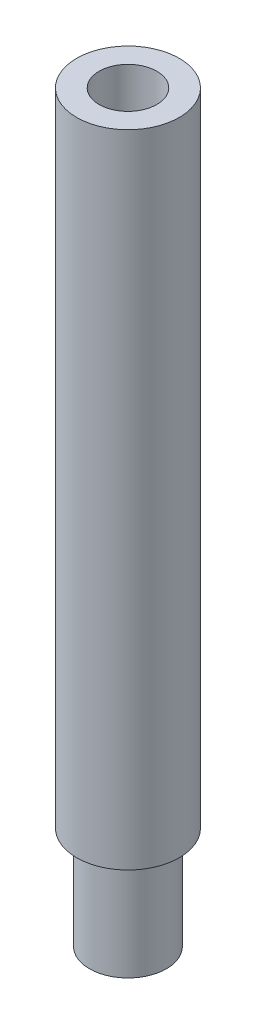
from build123d import *

# Parameters (mm, degrees)
F_5_16_24_TAPPED_HOLE1_D     = 6.9088
F_5_16_24_TAPPED_HOLE1_DEPTH = 21.336
F_5_16_24_TAPPED_HOLE1_TIP   = 2.075612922


with BuildPart() as part:
    # Sketch1 → Revolve1 (revolve)
    with BuildSketch(Plane.XY, mode=Mode.PRIVATE) as revolve1_sk:
        Polygon((0, 0), (9.525, 0), (9.525, 25.4), (12.7, 25.4), (12.7, 184.15), (7.14375, 184.15), (7.14375, 155.575), (0, 155.575), align=None)
    revolve(revolve1_sk.sketch.rotate(Axis((0, 0, 0), (0, -1, 0)), 90), axis=Axis((0, 0, 0), (0, -1, 0)))

    # 5_16-24 Tapped Hole1
    with Locations(Plane.XZ):
        with Locations((0, 0)):
            Hole(F_5_16_24_TAPPED_HOLE1_D / 2, depth=F_5_16_24_TAPPED_HOLE1_DEPTH)
            with Locations((0, 0, -(F_5_16_24_TAPPED_HOLE1_DEPTH + F_5_16_24_TAPPED_HOLE1_TIP / 2))):  # 118° drill point
                Cone(0, F_5_16_24_TAPPED_HOLE1_D / 2, F_5_16_24_TAPPED_HOLE1_TIP, mode=Mode.SUBTRACT)


solid = part.part
